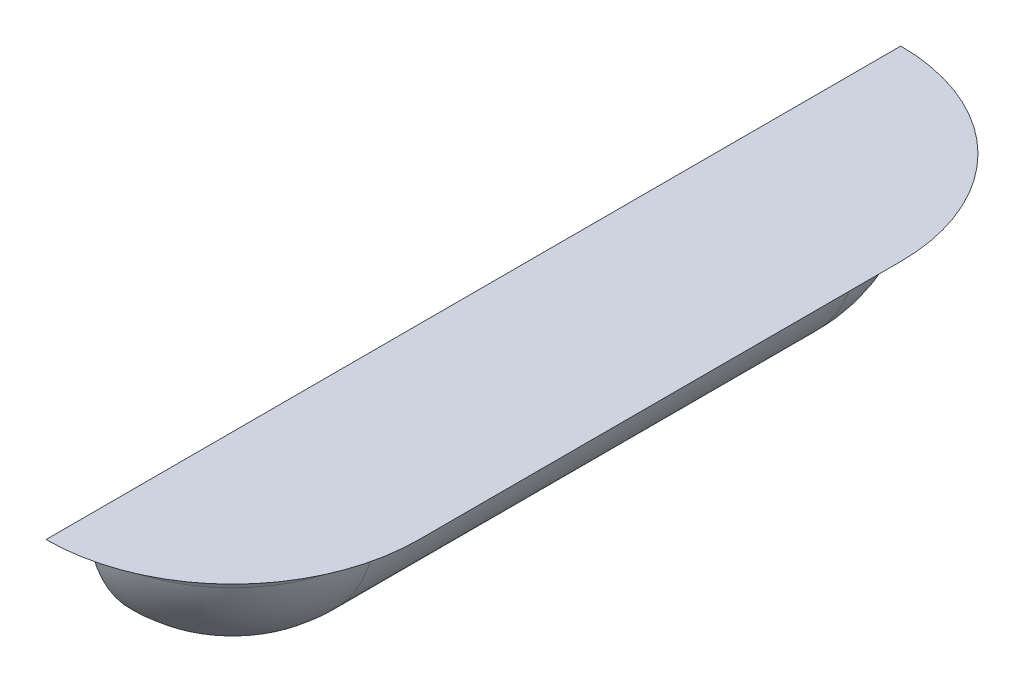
ISO-10303-21;
HEADER;
FILE_DESCRIPTION(('STEP AP214'),'2;1');
FILE_NAME('part.step','',(''),(''),'','','');
FILE_SCHEMA(('AUTOMOTIVE_DESIGN { 1 0 10303 214 1 1 1 1 }'));
ENDSEC;
DATA;
#1=APPLICATION_CONTEXT('core data for automotive mechanical design processes');
#2=APPLICATION_PROTOCOL_DEFINITION('international standard','automotive_design',2000,#1);
#3=PRODUCT_CONTEXT('',#1,'mechanical');
#4=PRODUCT('Part','Part','',(#3));
#5=PRODUCT_RELATED_PRODUCT_CATEGORY('part','',(#4));
#6=PRODUCT_DEFINITION_FORMATION('','',#4);
#7=PRODUCT_DEFINITION_CONTEXT('part definition',#1,'design');
#8=PRODUCT_DEFINITION('design','',#6,#7);
#9=PRODUCT_DEFINITION_SHAPE('','',#8);
#10=(LENGTH_UNIT() NAMED_UNIT(*) SI_UNIT(.MILLI.,.METRE.));
#11=(NAMED_UNIT(*) PLANE_ANGLE_UNIT() SI_UNIT($,.RADIAN.));
#12=(NAMED_UNIT(*) SI_UNIT($,.STERADIAN.) SOLID_ANGLE_UNIT());
#13=UNCERTAINTY_MEASURE_WITH_UNIT(LENGTH_MEASURE(1.E-05),#10,'distance_accuracy_value','');
#14=(GEOMETRIC_REPRESENTATION_CONTEXT(3) GLOBAL_UNCERTAINTY_ASSIGNED_CONTEXT((#13)) GLOBAL_UNIT_ASSIGNED_CONTEXT((#10,
#11,#12)) REPRESENTATION_CONTEXT('',''));
#15=CARTESIAN_POINT('',(0.,0.,0.));
#16=DIRECTION('',(0.,0.,1.));
#17=DIRECTION('',(1.,0.,0.));
#18=AXIS2_PLACEMENT_3D('',#15,#16,#17);
#19=CARTESIAN_POINT('',(-3.,0.,10.));
#20=DIRECTION('',(1.,0.,0.));
#21=DIRECTION('',(0.,0.,-1.));
#22=AXIS2_PLACEMENT_3D('',#19,#20,#21);
#23=PLANE('',#22);
#24=DIRECTION('',(0.,0.,-1.));
#25=VECTOR('',#24,1.);
#26=CARTESIAN_POINT('',(-3.,0.,10.));
#27=LINE('',#26,#25);
#28=CARTESIAN_POINT('',(-3.,0.,17.7459666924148));
#29=VERTEX_POINT('',#28);
#30=CARTESIAN_POINT('',(-3.,0.,-17.7459666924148));
#31=VERTEX_POINT('',#30);
#32=EDGE_CURVE('E401',#29,#31,#27,.T.);
#33=ORIENTED_EDGE('',*,*,#32,.T.);
#34=CARTESIAN_POINT('',(-3.,-2.,-17.7459666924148));
#35=DIRECTION('',(1.,0.,0.));
#36=DIRECTION('',(0.,0.,-1.));
#37=AXIS2_PLACEMENT_3D('',#34,#35,#36);
#38=CIRCLE('',#37,2.);
#39=CARTESIAN_POINT('',(-3.00000000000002,-1.5,-15.8094750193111));
#40=VERTEX_POINT('',#39);
#41=EDGE_CURVE('E11',#31,#40,#38,.T.);
#42=ORIENTED_EDGE('',*,*,#41,.T.);
#43=CARTESIAN_POINT('',(-3.,0.,-10.));
#44=DIRECTION('',(-1.,0.,0.));
#45=DIRECTION('',(0.,0.,1.));
#46=AXIS2_PLACEMENT_3D('',#43,#44,#45);
#47=CIRCLE('',#46,6.);
#48=CARTESIAN_POINT('',(-3.,-6.,-10.));
#49=VERTEX_POINT('',#48);
#50=EDGE_CURVE('E435',#40,#49,#47,.T.);
#51=ORIENTED_EDGE('',*,*,#50,.T.);
#52=DIRECTION('',(0.,0.,-1.));
#53=VECTOR('',#52,1.);
#54=CARTESIAN_POINT('',(-3.,-6.,10.));
#55=LINE('',#54,#53);
#56=CARTESIAN_POINT('',(-3.,-6.,10.));
#57=VERTEX_POINT('',#56);
#58=EDGE_CURVE('E431',#57,#49,#55,.T.);
#59=ORIENTED_EDGE('',*,*,#58,.F.);
#60=CARTESIAN_POINT('',(-3.,0.,10.));
#61=DIRECTION('',(-1.,0.,0.));
#62=DIRECTION('',(0.,0.,1.));
#63=AXIS2_PLACEMENT_3D('',#60,#61,#62);
#64=CIRCLE('',#63,6.);
#65=CARTESIAN_POINT('',(-3.00000000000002,-1.5,15.8094750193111));
#66=VERTEX_POINT('',#65);
#67=EDGE_CURVE('E429',#57,#66,#64,.T.);
#68=ORIENTED_EDGE('',*,*,#67,.T.);
#69=CARTESIAN_POINT('',(-3.,-2.,17.7459666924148));
#70=DIRECTION('',(1.,0.,0.));
#71=DIRECTION('',(0.,0.,-1.));
#72=AXIS2_PLACEMENT_3D('',#69,#70,#71);
#73=CIRCLE('',#72,2.);
#74=EDGE_CURVE('E357',#66,#29,#73,.T.);
#75=ORIENTED_EDGE('',*,*,#74,.T.);
#76=EDGE_LOOP('',(#33,#42,#51,#59,#68,#75));
#77=FACE_BOUND('',#76,.T.);
#78=ADVANCED_FACE('F349',(#77),#23,.F.);
#79=CARTESIAN_POINT('',(-3.,0.,10.));
#80=DIRECTION('',(0.,0.,-1.));
#81=DIRECTION('',(-1.,0.,0.));
#82=AXIS2_PLACEMENT_3D('',#79,#80,#81);
#83=CYLINDRICAL_SURFACE('',#82,6.);
#84=CARTESIAN_POINT('',(-3.,0.,-10.));
#85=DIRECTION('',(0.,0.,1.));
#86=DIRECTION('',(1.,0.,0.));
#87=AXIS2_PLACEMENT_3D('',#84,#85,#86);
#88=CIRCLE('',#87,6.);
#89=CARTESIAN_POINT('',(2.80947501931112,-1.5,-10.));
#90=VERTEX_POINT('',#89);
#91=EDGE_CURVE('E434',#49,#90,#88,.T.);
#92=ORIENTED_EDGE('',*,*,#91,.T.);
#93=DIRECTION('',(0.,0.,-1.));
#94=VECTOR('',#93,1.);
#95=CARTESIAN_POINT('',(2.80947501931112,-1.5,10.));
#96=LINE('',#95,#94);
#97=CARTESIAN_POINT('',(2.80947501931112,-1.5,10.));
#98=VERTEX_POINT('',#97);
#99=EDGE_CURVE('E424',#90,#98,#96,.F.);
#100=ORIENTED_EDGE('',*,*,#99,.T.);
#101=CARTESIAN_POINT('',(-3.,0.,10.));
#102=DIRECTION('',(0.,0.,1.));
#103=DIRECTION('',(1.,0.,0.));
#104=AXIS2_PLACEMENT_3D('',#101,#102,#103);
#105=CIRCLE('',#104,6.);
#106=EDGE_CURVE('E437',#57,#98,#105,.T.);
#107=ORIENTED_EDGE('',*,*,#106,.F.);
#108=ORIENTED_EDGE('',*,*,#58,.T.);
#109=EDGE_LOOP('',(#92,#100,#107,#108));
#110=FACE_BOUND('',#109,.T.);
#111=ADVANCED_FACE('F351',(#110),#83,.T.);
#112=CARTESIAN_POINT('',(-3.,0.,10.));
#113=DIRECTION('',(0.,1.,0.));
#114=DIRECTION('',(0.,0.,-1.));
#115=AXIS2_PLACEMENT_3D('',#112,#113,#114);
#116=SPHERICAL_SURFACE('',#115,6.);
#117=ORIENTED_EDGE('',*,*,#106,.T.);
#118=CARTESIAN_POINT('',(-3.,-1.5,10.));
#119=DIRECTION('',(0.,1.,0.));
#120=DIRECTION('',(0.,0.,1.));
#121=AXIS2_PLACEMENT_3D('',#118,#119,#120);
#122=CIRCLE('',#121,5.80947501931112);
#123=EDGE_CURVE('E405',#98,#66,#122,.F.);
#124=ORIENTED_EDGE('',*,*,#123,.T.);
#125=ORIENTED_EDGE('',*,*,#67,.F.);
#126=EDGE_LOOP('',(#117,#124,#125));
#127=FACE_BOUND('',#126,.T.);
#128=ADVANCED_FACE('F444',(#127),#116,.T.);
#129=CARTESIAN_POINT('',(-3.,0.,-10.));
#130=DIRECTION('',(0.,-1.,0.));
#131=DIRECTION('',(0.,0.,-1.));
#132=AXIS2_PLACEMENT_3D('',#129,#130,#131);
#133=SPHERICAL_SURFACE('',#132,6.);
#134=ORIENTED_EDGE('',*,*,#50,.F.);
#135=CARTESIAN_POINT('',(-3.,-1.5,-10.));
#136=DIRECTION('',(0.,1.,0.));
#137=DIRECTION('',(0.,0.,1.));
#138=AXIS2_PLACEMENT_3D('',#135,#136,#137);
#139=CIRCLE('',#138,5.80947501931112);
#140=EDGE_CURVE('E369',#40,#90,#139,.F.);
#141=ORIENTED_EDGE('',*,*,#140,.T.);
#142=ORIENTED_EDGE('',*,*,#91,.F.);
#143=EDGE_LOOP('',(#134,#141,#142));
#144=FACE_BOUND('',#143,.T.);
#145=ADVANCED_FACE('F446',(#144),#133,.T.);
#146=CARTESIAN_POINT('',(-3.,-2.,-10.));
#147=DIRECTION('',(0.,1.,0.));
#148=DIRECTION('',(0.,0.,1.));
#149=AXIS2_PLACEMENT_3D('',#146,#147,#148);
#150=TOROIDAL_SURFACE('',#149,7.74596669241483,2.);
#151=ORIENTED_EDGE('',*,*,#41,.F.);
#152=CARTESIAN_POINT('',(-3.,0.,-10.));
#153=DIRECTION('',(0.,1.,0.));
#154=DIRECTION('',(0.,0.,1.));
#155=AXIS2_PLACEMENT_3D('',#152,#153,#154);
#156=CIRCLE('',#155,7.74596669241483);
#157=CARTESIAN_POINT('',(4.74596669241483,0.,-10.));
#158=VERTEX_POINT('',#157);
#159=EDGE_CURVE('E418',#158,#31,#156,.T.);
#160=ORIENTED_EDGE('',*,*,#159,.F.);
#161=CARTESIAN_POINT('',(4.74596669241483,-2.,-10.));
#162=DIRECTION('',(0.,0.,-1.));
#163=DIRECTION('',(-1.,0.,0.));
#164=AXIS2_PLACEMENT_3D('',#161,#162,#163);
#165=CIRCLE('',#164,2.);
#166=EDGE_CURVE('E413',#90,#158,#165,.T.);
#167=ORIENTED_EDGE('',*,*,#166,.F.);
#168=ORIENTED_EDGE('',*,*,#140,.F.);
#169=EDGE_LOOP('',(#151,#160,#167,#168));
#170=FACE_BOUND('',#169,.T.);
#171=ADVANCED_FACE('F452',(#170),#150,.F.);
#172=CARTESIAN_POINT('',(4.74596669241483,-2.,10.));
#173=DIRECTION('',(0.,0.,-1.));
#174=DIRECTION('',(-1.,0.,0.));
#175=AXIS2_PLACEMENT_3D('',#172,#173,#174);
#176=CYLINDRICAL_SURFACE('',#175,2.);
#177=ORIENTED_EDGE('',*,*,#166,.T.);
#178=DIRECTION('',(0.,0.,1.));
#179=VECTOR('',#178,1.);
#180=CARTESIAN_POINT('',(4.74596669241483,0.,-10.));
#181=LINE('',#180,#179);
#182=CARTESIAN_POINT('',(4.74596669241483,0.,10.));
#183=VERTEX_POINT('',#182);
#184=EDGE_CURVE('E399',#183,#158,#181,.F.);
#185=ORIENTED_EDGE('',*,*,#184,.F.);
#186=CARTESIAN_POINT('',(4.74596669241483,-2.,10.));
#187=DIRECTION('',(0.,0.,-1.));
#188=DIRECTION('',(-1.,0.,0.));
#189=AXIS2_PLACEMENT_3D('',#186,#187,#188);
#190=CIRCLE('',#189,2.);
#191=EDGE_CURVE('E409',#98,#183,#190,.T.);
#192=ORIENTED_EDGE('',*,*,#191,.F.);
#193=ORIENTED_EDGE('',*,*,#99,.F.);
#194=EDGE_LOOP('',(#177,#185,#192,#193));
#195=FACE_BOUND('',#194,.T.);
#196=ADVANCED_FACE('F416',(#195),#176,.F.);
#197=CARTESIAN_POINT('',(-3.,-2.,10.));
#198=DIRECTION('',(0.,1.,0.));
#199=DIRECTION('',(0.,0.,1.));
#200=AXIS2_PLACEMENT_3D('',#197,#198,#199);
#201=TOROIDAL_SURFACE('',#200,7.74596669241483,2.);
#202=ORIENTED_EDGE('',*,*,#74,.F.);
#203=ORIENTED_EDGE('',*,*,#123,.F.);
#204=ORIENTED_EDGE('',*,*,#191,.T.);
#205=CARTESIAN_POINT('',(-3.,0.,10.));
#206=DIRECTION('',(0.,1.,0.));
#207=DIRECTION('',(0.,0.,1.));
#208=AXIS2_PLACEMENT_3D('',#205,#206,#207);
#209=CIRCLE('',#208,7.74596669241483);
#210=EDGE_CURVE('E395',#29,#183,#209,.T.);
#211=ORIENTED_EDGE('',*,*,#210,.F.);
#212=EDGE_LOOP('',(#202,#203,#204,#211));
#213=FACE_BOUND('',#212,.T.);
#214=ADVANCED_FACE('F410',(#213),#201,.F.);
#215=CARTESIAN_POINT('',(15.,0.,-25.));
#216=DIRECTION('',(0.,-1.,0.));
#217=DIRECTION('',(0.,0.,-1.));
#218=AXIS2_PLACEMENT_3D('',#215,#216,#217);
#219=PLANE('',#218);
#220=ORIENTED_EDGE('',*,*,#210,.T.);
#221=ORIENTED_EDGE('',*,*,#184,.T.);
#222=ORIENTED_EDGE('',*,*,#159,.T.);
#223=ORIENTED_EDGE('',*,*,#32,.F.);
#224=EDGE_LOOP('',(#220,#221,#222,#223));
#225=FACE_BOUND('',#224,.T.);
#226=ADVANCED_FACE('F397',(#225),#219,.F.);
#227=CLOSED_SHELL('',(#78,#111,#128,#145,#171,#196,#214,#226));
#228=MANIFOLD_SOLID_BREP('B2',#227);
#229=ADVANCED_BREP_SHAPE_REPRESENTATION('',(#18,#228),#14);
#230=SHAPE_DEFINITION_REPRESENTATION(#9,#229);
ENDSEC;
END-ISO-10303-21;
